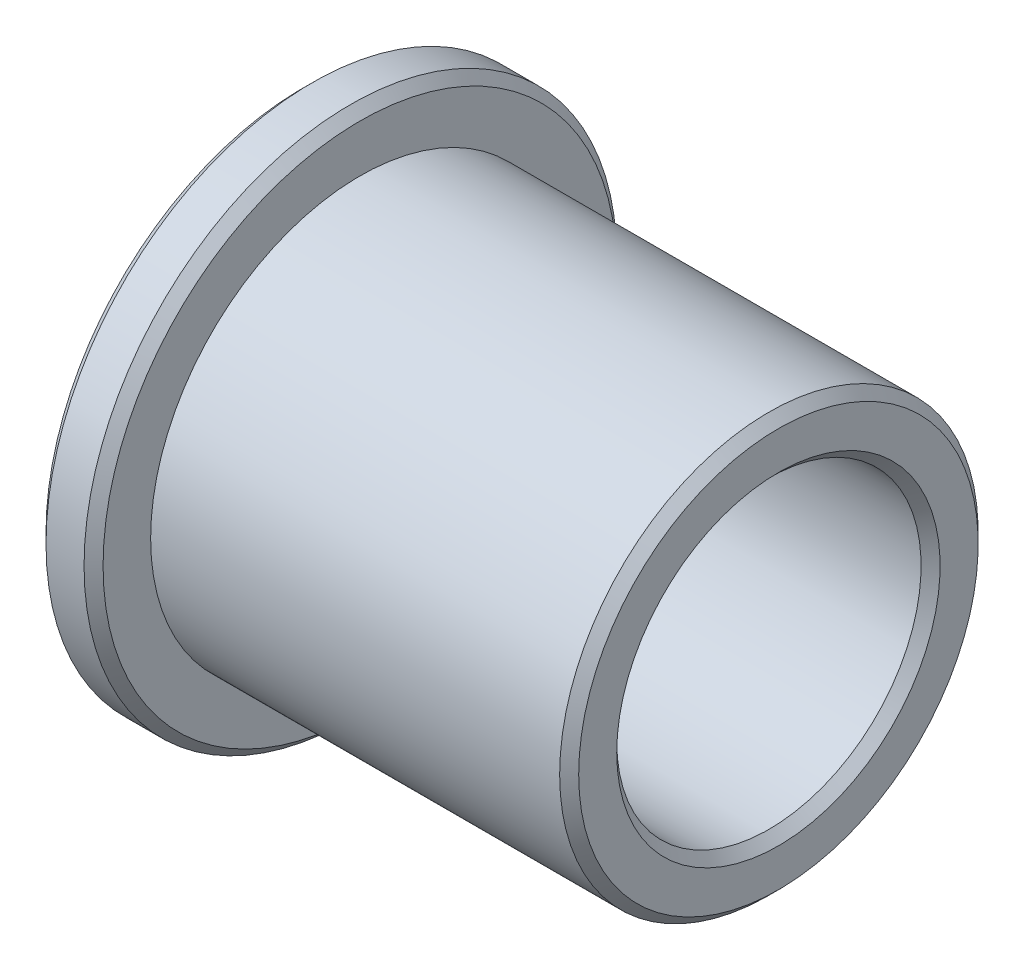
from build123d import *


with BuildPart() as part:
    # Esquisse1 → Base-R_volution (revolve)
    with BuildSketch(Plane.XY, mode=Mode.PRIVATE) as base_r_volution_sk:
        Polygon((0, 8.5), (0, 13.5), (0.5, 14), (2.5, 14), (3, 13.5), (3, 11), (24.5, 11), (25, 10.5), (25, 8.5), (24.5, 8), (0.5, 8), align=None)
    revolve(base_r_volution_sk.sketch.rotate(Axis((-31.662967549, 0, 0), (1, 0, 0)), 90), axis=Axis((-31.662967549, 0, 0), (1, 0, 0)))


solid = part.part
